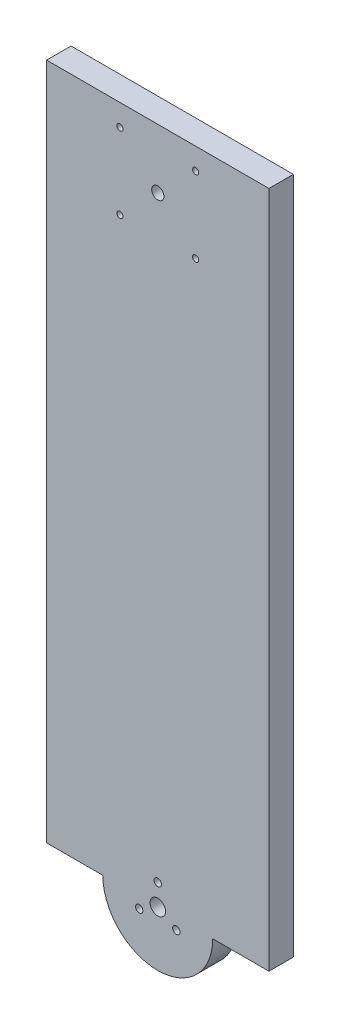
from build123d import *

# Parameters (mm, degrees)
SKETCH1_R           = 1.25
SKETCH1_R_2         = 2.5
SKETCH1_R_3         = 1.5
SKETCH1_R_4         = 3.15
BOSS_EXTRUDE1_DEPTH = 10
SKETCH2_W           = 10
SKETCH2_H           = 277.5
BOSS_EXTRUDE2_DEPTH = 23
SKETCH3_W           = 10
SKETCH3_H           = 277.5
BOSS_EXTRUDE3_DEPTH = 23


with BuildPart() as part:
    # Sketch1 → Boss-Extrude1 (new body)
    with BuildSketch(Plane.XY):
        with BuildLine():
            Line((-22.5, 130), (22.5, 130))
            Line((22.5, 130), (22.5, -147.5))
            ThreePointArc((22.5, -147.5), (0, -170), (-22.5, -147.5))
            Line((-22.5, -147.5), (-22.5, 130))
        make_face()
        with Locations((-15.5, 121.163920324)):
            Circle(SKETCH1_R, mode=Mode.SUBTRACT)
        with Locations(Location((15.5, 121.163920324, 0), (0, 0, 180))):
            Circle(SKETCH1_R, mode=Mode.SUBTRACT)
        with Locations((15.5, 90.163920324)):
            Circle(SKETCH1_R, mode=Mode.SUBTRACT)
        with Locations(Location((-15.5, 90.163920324, 0), (0, 0, 180))):
            Circle(SKETCH1_R, mode=Mode.SUBTRACT)
        with Locations((0, 105.663920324)):
            Circle(SKETCH1_R_2, mode=Mode.SUBTRACT)
        with Locations((0, -138.75)):
            Circle(SKETCH1_R_3, mode=Mode.SUBTRACT)
        with Locations((7.577722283, -151.875)):
            Circle(SKETCH1_R_3, mode=Mode.SUBTRACT)
        with Locations((-7.577722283, -151.875)):
            Circle(SKETCH1_R_3, mode=Mode.SUBTRACT)
        with Locations((0, -147.5)):
            Circle(SKETCH1_R_4, mode=Mode.SUBTRACT)
    extrude(amount=BOSS_EXTRUDE1_DEPTH)

    # Sketch2 → Boss-Extrude2 (add)
    with BuildSketch(Plane(origin=(22.5, 0, 0), x_dir=(0, 0, -1), z_dir=(1, 0, 0))):
        with Locations((-5, -8.75)):
            Rectangle(SKETCH2_W, SKETCH2_H)
    extrude(amount=BOSS_EXTRUDE2_DEPTH)

    # Sketch3 → Boss-Extrude3 (add)
    with BuildSketch(Plane.ZY.offset(22.5)):
        with Locations((5, -8.75)):
            Rectangle(SKETCH3_W, SKETCH3_H)
    extrude(amount=BOSS_EXTRUDE3_DEPTH)


solid = part.part
